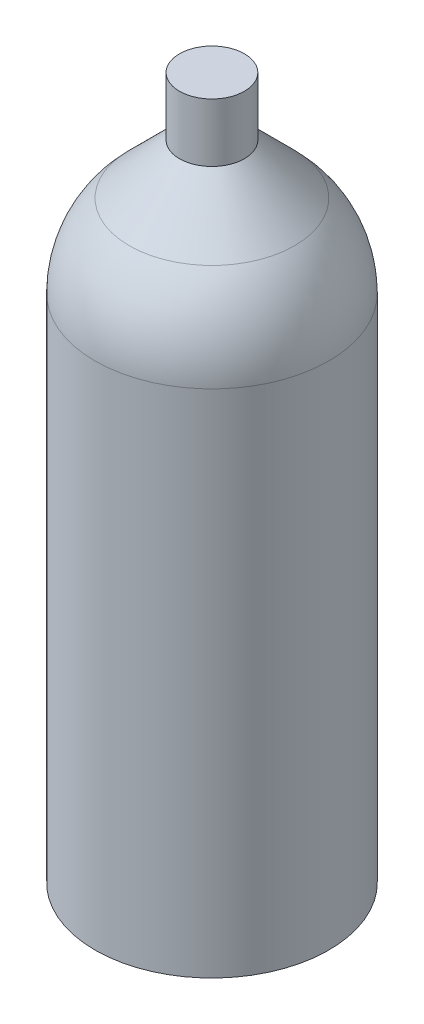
from build123d import *

# Parameters (mm, degrees)
CONG_1_R = 10


with BuildPart() as part:
    # Esquisse1 → R_volution1 (revolve)
    with BuildSketch(Plane.XY, mode=Mode.PRIVATE) as r_volution1_sk:
        Polygon((2.776063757, 60), (2.776063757, 55), (10, 47.776063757), (10, 0), (0, 0), (0, 60), align=None)
    revolve(r_volution1_sk.sketch.rotate(Axis((0, 67.573964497, 0), (0, -1, 0)), 90), axis=Axis((0, 67.573964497, 0), (0, -1, 0)))

    # Cong_1
    cong_1_edges = [part.edges().sort_by_distance(p)[0] for p in [
        (0, 47.776063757, -10),
    ]]
    fillet(cong_1_edges, radius=CONG_1_R)


solid = part.part
